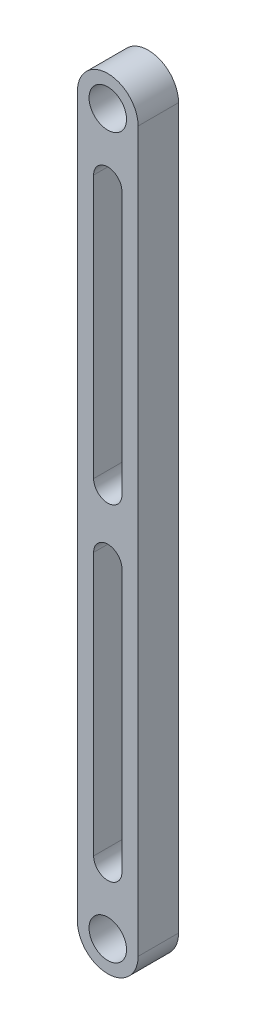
from build123d import *

# Parameters (mm, degrees)
SKETCH1_R           = 4.635
BOSS_EXTRUDE1_DEPTH = 10


with BuildPart() as part:
    # Sketch1 → Boss-Extrude1 (new body)
    with BuildSketch(Plane.XY):
        with BuildLine():
            Line((-7.5, -88.9), (-7.5, 88.9))
            ThreePointArc((-7.5, 88.9), (0, 96.4), (7.5, 88.9))
            Line((7.5, 88.9), (7.5, -88.9))
            ThreePointArc((7.5, -88.9), (0, -96.4), (-7.5, -88.9))
        make_face()
        with Locations((0, -88.9)):
            Circle(SKETCH1_R, mode=Mode.SUBTRACT)
        with Locations((0, 88.9)):
            Circle(SKETCH1_R, mode=Mode.SUBTRACT)
        with BuildLine():
            Line((-3.5, -72.9), (-3.5, -7.9))
            ThreePointArc((-3.5, -7.9), (0, -4.4), (3.5, -7.9))
            Line((3.5, -7.9), (3.5, -72.9))
            ThreePointArc((3.5, -72.9), (0, -76.4), (-3.5, -72.9))
        make_face(mode=Mode.SUBTRACT)
        with BuildLine():
            Line((3.5, 72.9), (3.5, 7.9))
            ThreePointArc((3.5, 7.9), (0, 4.4), (-3.5, 7.9))
            Line((-3.5, 7.9), (-3.5, 72.9))
            ThreePointArc((-3.5, 72.9), (0, 76.4), (3.5, 72.9))
        make_face(mode=Mode.SUBTRACT)
    extrude(amount=BOSS_EXTRUDE1_DEPTH)


solid = part.part
